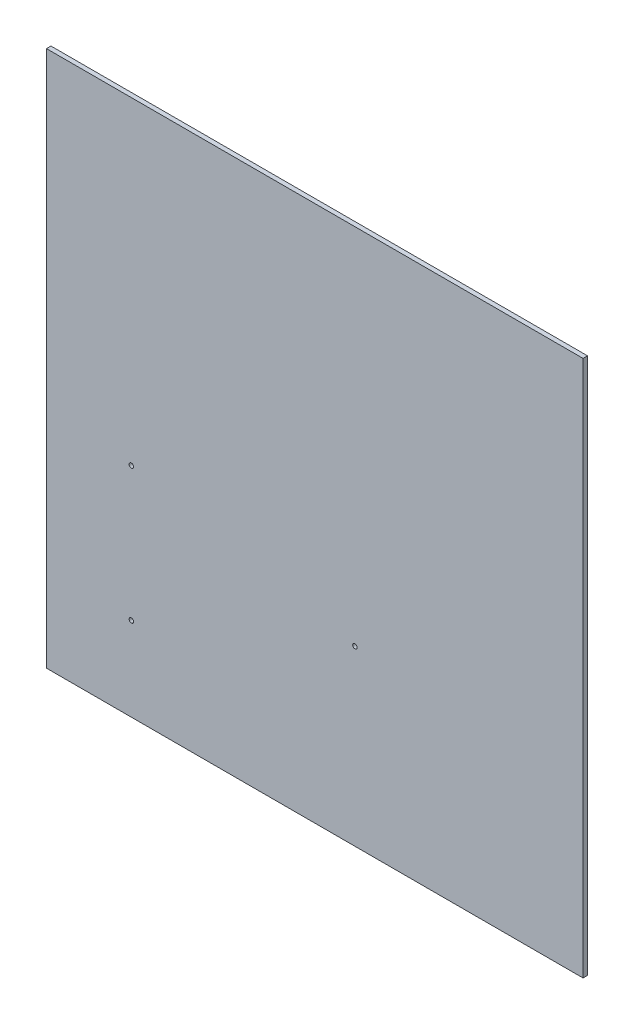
ISO-10303-21;
HEADER;
FILE_DESCRIPTION(('STEP AP214'),'2;1');
FILE_NAME('part.step','',(''),(''),'','','');
FILE_SCHEMA(('AUTOMOTIVE_DESIGN { 1 0 10303 214 1 1 1 1 }'));
ENDSEC;
DATA;
#1=APPLICATION_CONTEXT('core data for automotive mechanical design processes');
#2=APPLICATION_PROTOCOL_DEFINITION('international standard','automotive_design',2000,#1);
#3=PRODUCT_CONTEXT('',#1,'mechanical');
#4=PRODUCT('Part','Part','',(#3));
#5=PRODUCT_RELATED_PRODUCT_CATEGORY('part','',(#4));
#6=PRODUCT_DEFINITION_FORMATION('','',#4);
#7=PRODUCT_DEFINITION_CONTEXT('part definition',#1,'design');
#8=PRODUCT_DEFINITION('design','',#6,#7);
#9=PRODUCT_DEFINITION_SHAPE('','',#8);
#10=(LENGTH_UNIT() NAMED_UNIT(*) SI_UNIT(.MILLI.,.METRE.));
#11=(NAMED_UNIT(*) PLANE_ANGLE_UNIT() SI_UNIT($,.RADIAN.));
#12=(NAMED_UNIT(*) SI_UNIT($,.STERADIAN.) SOLID_ANGLE_UNIT());
#13=UNCERTAINTY_MEASURE_WITH_UNIT(LENGTH_MEASURE(1.E-05),#10,'distance_accuracy_value','');
#14=(GEOMETRIC_REPRESENTATION_CONTEXT(3) GLOBAL_UNCERTAINTY_ASSIGNED_CONTEXT((#13)) GLOBAL_UNIT_ASSIGNED_CONTEXT((#10,
#11,#12)) REPRESENTATION_CONTEXT('',''));
#15=CARTESIAN_POINT('',(0.,0.,0.));
#16=DIRECTION('',(0.,0.,1.));
#17=DIRECTION('',(1.,0.,0.));
#18=AXIS2_PLACEMENT_3D('',#15,#16,#17);
#19=CARTESIAN_POINT('',(0.,0.,2.54));
#20=DIRECTION('',(1.,0.,0.));
#21=DIRECTION('',(0.,0.,-1.));
#22=AXIS2_PLACEMENT_3D('',#19,#20,#21);
#23=PLANE('',#22);
#24=DIRECTION('',(0.,-1.,0.));
#25=VECTOR('',#24,1.);
#26=CARTESIAN_POINT('',(0.,0.,0.));
#27=LINE('',#26,#25);
#28=CARTESIAN_POINT('',(0.,304.8,0.));
#29=VERTEX_POINT('',#28);
#30=CARTESIAN_POINT('',(0.,0.,0.));
#31=VERTEX_POINT('',#30);
#32=EDGE_CURVE('E96',#29,#31,#27,.T.);
#33=ORIENTED_EDGE('',*,*,#32,.T.);
#34=DIRECTION('',(0.,0.,-1.));
#35=VECTOR('',#34,1.);
#36=CARTESIAN_POINT('',(0.,0.,2.54));
#37=LINE('',#36,#35);
#38=CARTESIAN_POINT('',(0.,0.,2.54));
#39=VERTEX_POINT('',#38);
#40=EDGE_CURVE('E11',#39,#31,#37,.T.);
#41=ORIENTED_EDGE('',*,*,#40,.F.);
#42=DIRECTION('',(0.,-1.,0.));
#43=VECTOR('',#42,1.);
#44=CARTESIAN_POINT('',(0.,0.,2.54));
#45=LINE('',#44,#43);
#46=CARTESIAN_POINT('',(0.,304.8,2.54));
#47=VERTEX_POINT('',#46);
#48=EDGE_CURVE('E84',#47,#39,#45,.T.);
#49=ORIENTED_EDGE('',*,*,#48,.F.);
#50=DIRECTION('',(0.,0.,-1.));
#51=VECTOR('',#50,1.);
#52=CARTESIAN_POINT('',(0.,304.8,2.54));
#53=LINE('',#52,#51);
#54=EDGE_CURVE('E92',#47,#29,#53,.T.);
#55=ORIENTED_EDGE('',*,*,#54,.T.);
#56=EDGE_LOOP('',(#33,#41,#49,#55));
#57=FACE_BOUND('',#56,.T.);
#58=ADVANCED_FACE('F33',(#57),#23,.F.);
#59=CARTESIAN_POINT('',(0.,0.,2.54));
#60=DIRECTION('',(0.,1.,0.));
#61=DIRECTION('',(0.,0.,1.));
#62=AXIS2_PLACEMENT_3D('',#59,#60,#61);
#63=PLANE('',#62);
#64=DIRECTION('',(1.,0.,0.));
#65=VECTOR('',#64,1.);
#66=CARTESIAN_POINT('',(0.,0.,0.));
#67=LINE('',#66,#65);
#68=CARTESIAN_POINT('',(304.8,0.,0.));
#69=VERTEX_POINT('',#68);
#70=EDGE_CURVE('E88',#31,#69,#67,.T.);
#71=ORIENTED_EDGE('',*,*,#70,.T.);
#72=DIRECTION('',(0.,0.,-1.));
#73=VECTOR('',#72,1.);
#74=CARTESIAN_POINT('',(304.8,0.,2.54));
#75=LINE('',#74,#73);
#76=CARTESIAN_POINT('',(304.8,0.,2.54));
#77=VERTEX_POINT('',#76);
#78=EDGE_CURVE('E41',#77,#69,#75,.T.);
#79=ORIENTED_EDGE('',*,*,#78,.F.);
#80=DIRECTION('',(1.,0.,0.));
#81=VECTOR('',#80,1.);
#82=CARTESIAN_POINT('',(0.,0.,2.54));
#83=LINE('',#82,#81);
#84=EDGE_CURVE('E79',#39,#77,#83,.T.);
#85=ORIENTED_EDGE('',*,*,#84,.F.);
#86=ORIENTED_EDGE('',*,*,#40,.T.);
#87=EDGE_LOOP('',(#71,#79,#85,#86));
#88=FACE_BOUND('',#87,.T.);
#89=ADVANCED_FACE('F87',(#88),#63,.F.);
#90=CARTESIAN_POINT('',(304.8,0.,2.54));
#91=DIRECTION('',(-1.,0.,0.));
#92=DIRECTION('',(0.,0.,1.));
#93=AXIS2_PLACEMENT_3D('',#90,#91,#92);
#94=PLANE('',#93);
#95=DIRECTION('',(0.,1.,0.));
#96=VECTOR('',#95,1.);
#97=CARTESIAN_POINT('',(304.8,0.,0.));
#98=LINE('',#97,#96);
#99=CARTESIAN_POINT('',(304.8,304.8,0.));
#100=VERTEX_POINT('',#99);
#101=EDGE_CURVE('E66',#69,#100,#98,.T.);
#102=ORIENTED_EDGE('',*,*,#101,.T.);
#103=DIRECTION('',(0.,0.,-1.));
#104=VECTOR('',#103,1.);
#105=CARTESIAN_POINT('',(304.8,304.8,2.54));
#106=LINE('',#105,#104);
#107=CARTESIAN_POINT('',(304.8,304.8,2.54));
#108=VERTEX_POINT('',#107);
#109=EDGE_CURVE('E89',#108,#100,#106,.T.);
#110=ORIENTED_EDGE('',*,*,#109,.F.);
#111=DIRECTION('',(0.,1.,0.));
#112=VECTOR('',#111,1.);
#113=CARTESIAN_POINT('',(304.8,0.,2.54));
#114=LINE('',#113,#112);
#115=EDGE_CURVE('E82',#77,#108,#114,.T.);
#116=ORIENTED_EDGE('',*,*,#115,.F.);
#117=ORIENTED_EDGE('',*,*,#78,.T.);
#118=EDGE_LOOP('',(#102,#110,#116,#117));
#119=FACE_BOUND('',#118,.T.);
#120=ADVANCED_FACE('F90',(#119),#94,.F.);
#121=CARTESIAN_POINT('',(0.,304.8,2.54));
#122=DIRECTION('',(0.,-1.,0.));
#123=DIRECTION('',(0.,0.,-1.));
#124=AXIS2_PLACEMENT_3D('',#121,#122,#123);
#125=PLANE('',#124);
#126=DIRECTION('',(-1.,0.,0.));
#127=VECTOR('',#126,1.);
#128=CARTESIAN_POINT('',(0.,304.8,0.));
#129=LINE('',#128,#127);
#130=EDGE_CURVE('E72',#100,#29,#129,.T.);
#131=ORIENTED_EDGE('',*,*,#130,.T.);
#132=ORIENTED_EDGE('',*,*,#54,.F.);
#133=DIRECTION('',(-1.,0.,0.));
#134=VECTOR('',#133,1.);
#135=CARTESIAN_POINT('',(0.,304.8,2.54));
#136=LINE('',#135,#134);
#137=EDGE_CURVE('E49',#108,#47,#136,.T.);
#138=ORIENTED_EDGE('',*,*,#137,.F.);
#139=ORIENTED_EDGE('',*,*,#109,.T.);
#140=EDGE_LOOP('',(#131,#132,#138,#139));
#141=FACE_BOUND('',#140,.T.);
#142=ADVANCED_FACE('F104',(#141),#125,.F.);
#143=CARTESIAN_POINT('',(0.,0.,2.54));
#144=DIRECTION('',(0.,0.,-1.));
#145=DIRECTION('',(-1.,0.,0.));
#146=AXIS2_PLACEMENT_3D('',#143,#144,#145);
#147=PLANE('',#146);
#148=CARTESIAN_POINT('',(48.2049917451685,47.5896668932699,2.54));
#149=DIRECTION('',(0.,0.,-1.));
#150=DIRECTION('',(-1.,0.,0.));
#151=AXIS2_PLACEMENT_3D('',#148,#149,#150);
#152=CIRCLE('',#151,1.27);
#153=CARTESIAN_POINT('',(46.9349917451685,47.5896668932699,2.54));
#154=VERTEX_POINT('',#153);
#155=EDGE_CURVE('E99',#154,#154,#152,.T.);
#156=ORIENTED_EDGE('',*,*,#155,.T.);
#157=EDGE_LOOP('',(#156));
#158=FACE_BOUND('',#157,.T.);
#159=CARTESIAN_POINT('',(175.204991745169,98.3896668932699,2.54));
#160=DIRECTION('',(0.,0.,-1.));
#161=DIRECTION('',(-1.,0.,0.));
#162=AXIS2_PLACEMENT_3D('',#159,#160,#161);
#163=CIRCLE('',#162,1.27000000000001);
#164=CARTESIAN_POINT('',(173.934991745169,98.3896668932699,2.54));
#165=VERTEX_POINT('',#164);
#166=EDGE_CURVE('E112',#165,#165,#163,.T.);
#167=ORIENTED_EDGE('',*,*,#166,.T.);
#168=EDGE_LOOP('',(#167));
#169=FACE_BOUND('',#168,.T.);
#170=CARTESIAN_POINT('',(48.2049917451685,123.78966689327,2.54));
#171=DIRECTION('',(0.,0.,-1.));
#172=DIRECTION('',(-1.,0.,0.));
#173=AXIS2_PLACEMENT_3D('',#170,#171,#172);
#174=CIRCLE('',#173,1.27);
#175=CARTESIAN_POINT('',(46.9349917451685,123.78966689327,2.54));
#176=VERTEX_POINT('',#175);
#177=EDGE_CURVE('E115',#176,#176,#174,.T.);
#178=ORIENTED_EDGE('',*,*,#177,.T.);
#179=EDGE_LOOP('',(#178));
#180=FACE_BOUND('',#179,.T.);
#181=ORIENTED_EDGE('',*,*,#48,.T.);
#182=ORIENTED_EDGE('',*,*,#84,.T.);
#183=ORIENTED_EDGE('',*,*,#115,.T.);
#184=ORIENTED_EDGE('',*,*,#137,.T.);
#185=EDGE_LOOP('',(#181,#182,#183,#184));
#186=FACE_BOUND('',#185,.T.);
#187=ADVANCED_FACE('F80',(#158,#169,#180,#186),#147,.F.);
#188=CARTESIAN_POINT('',(0.,0.,0.));
#189=DIRECTION('',(0.,0.,-1.));
#190=DIRECTION('',(-1.,0.,0.));
#191=AXIS2_PLACEMENT_3D('',#188,#189,#190);
#192=PLANE('',#191);
#193=CARTESIAN_POINT('',(48.2049917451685,47.5896668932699,0.));
#194=DIRECTION('',(0.,0.,1.));
#195=DIRECTION('',(1.,0.,0.));
#196=AXIS2_PLACEMENT_3D('',#193,#194,#195);
#197=CIRCLE('',#196,1.27);
#198=CARTESIAN_POINT('',(49.4749917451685,47.5896668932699,0.));
#199=VERTEX_POINT('',#198);
#200=EDGE_CURVE('E118',#199,#199,#197,.T.);
#201=ORIENTED_EDGE('',*,*,#200,.T.);
#202=EDGE_LOOP('',(#201));
#203=FACE_BOUND('',#202,.T.);
#204=CARTESIAN_POINT('',(175.204991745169,98.3896668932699,0.));
#205=DIRECTION('',(0.,0.,1.));
#206=DIRECTION('',(1.,0.,0.));
#207=AXIS2_PLACEMENT_3D('',#204,#205,#206);
#208=CIRCLE('',#207,1.27000000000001);
#209=CARTESIAN_POINT('',(176.474991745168,98.3896668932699,0.));
#210=VERTEX_POINT('',#209);
#211=EDGE_CURVE('E122',#210,#210,#208,.T.);
#212=ORIENTED_EDGE('',*,*,#211,.T.);
#213=EDGE_LOOP('',(#212));
#214=FACE_BOUND('',#213,.T.);
#215=CARTESIAN_POINT('',(48.2049917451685,123.78966689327,0.));
#216=DIRECTION('',(0.,0.,1.));
#217=DIRECTION('',(1.,0.,0.));
#218=AXIS2_PLACEMENT_3D('',#215,#216,#217);
#219=CIRCLE('',#218,1.27);
#220=CARTESIAN_POINT('',(49.4749917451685,123.78966689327,0.));
#221=VERTEX_POINT('',#220);
#222=EDGE_CURVE('E119',#221,#221,#219,.T.);
#223=ORIENTED_EDGE('',*,*,#222,.T.);
#224=EDGE_LOOP('',(#223));
#225=FACE_BOUND('',#224,.T.);
#226=ORIENTED_EDGE('',*,*,#32,.F.);
#227=ORIENTED_EDGE('',*,*,#130,.F.);
#228=ORIENTED_EDGE('',*,*,#101,.F.);
#229=ORIENTED_EDGE('',*,*,#70,.F.);
#230=EDGE_LOOP('',(#226,#227,#228,#229));
#231=FACE_BOUND('',#230,.T.);
#232=ADVANCED_FACE('F107',(#203,#214,#225,#231),#192,.T.);
#233=CARTESIAN_POINT('',(48.2049917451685,123.78966689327,0.));
#234=DIRECTION('',(0.,0.,1.));
#235=DIRECTION('',(1.,0.,0.));
#236=AXIS2_PLACEMENT_3D('',#233,#234,#235);
#237=CYLINDRICAL_SURFACE('',#236,1.27);
#238=ORIENTED_EDGE('',*,*,#222,.F.);
#239=EDGE_LOOP('',(#238));
#240=FACE_BOUND('',#239,.T.);
#241=ORIENTED_EDGE('',*,*,#177,.F.);
#242=EDGE_LOOP('',(#241));
#243=FACE_BOUND('',#242,.T.);
#244=ADVANCED_FACE('F144',(#240,#243),#237,.F.);
#245=CARTESIAN_POINT('',(175.204991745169,98.3896668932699,0.));
#246=DIRECTION('',(0.,0.,1.));
#247=DIRECTION('',(1.,0.,0.));
#248=AXIS2_PLACEMENT_3D('',#245,#246,#247);
#249=CYLINDRICAL_SURFACE('',#248,1.27000000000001);
#250=ORIENTED_EDGE('',*,*,#211,.F.);
#251=EDGE_LOOP('',(#250));
#252=FACE_BOUND('',#251,.T.);
#253=ORIENTED_EDGE('',*,*,#166,.F.);
#254=EDGE_LOOP('',(#253));
#255=FACE_BOUND('',#254,.T.);
#256=ADVANCED_FACE('F133',(#252,#255),#249,.F.);
#257=CARTESIAN_POINT('',(48.2049917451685,47.5896668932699,0.));
#258=DIRECTION('',(0.,0.,1.));
#259=DIRECTION('',(1.,0.,0.));
#260=AXIS2_PLACEMENT_3D('',#257,#258,#259);
#261=CYLINDRICAL_SURFACE('',#260,1.27);
#262=ORIENTED_EDGE('',*,*,#200,.F.);
#263=EDGE_LOOP('',(#262));
#264=FACE_BOUND('',#263,.T.);
#265=ORIENTED_EDGE('',*,*,#155,.F.);
#266=EDGE_LOOP('',(#265));
#267=FACE_BOUND('',#266,.T.);
#268=ADVANCED_FACE('F130',(#264,#267),#261,.F.);
#269=CLOSED_SHELL('',(#58,#89,#120,#142,#187,#232,#244,#256,#268));
#270=MANIFOLD_SOLID_BREP('B2',#269);
#271=ADVANCED_BREP_SHAPE_REPRESENTATION('',(#18,#270),#14);
#272=SHAPE_DEFINITION_REPRESENTATION(#9,#271);
ENDSEC;
END-ISO-10303-21;
